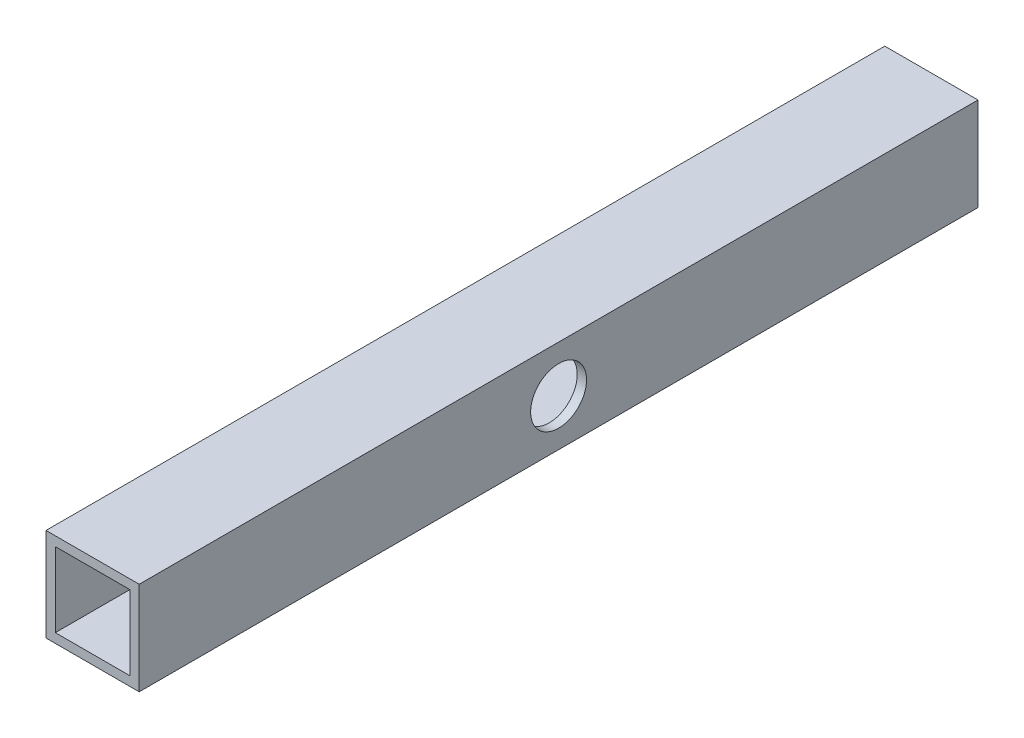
from build123d import *

# Parameters (mm, degrees)
ESQUISSE1_W             = 50
ESQUISSE1_H             = 50
ESQUISSE1_W_2           = 40
ESQUISSE1_H_2           = 40
BOSS_EXTRU_1_DEPTH      = 450
ESQUISSE2_R             = 15
ENL_V_MAT_EXTRU_1_DEPTH = 79


with BuildPart() as part:
    # Esquisse1 → Boss.-Extru.1 (new body)
    with BuildSketch(Plane.XY):
        with Locations((-25, 25)):
            Rectangle(ESQUISSE1_W, ESQUISSE1_H)
        with Locations((-25, 25)):
            Rectangle(ESQUISSE1_W_2, ESQUISSE1_H_2, mode=Mode.SUBTRACT)
    extrude(amount=BOSS_EXTRU_1_DEPTH)

    # Esquisse2 → Enl_v. mat.-Extru.1 (cut)
    with BuildSketch(Plane(origin=(0, 0, 0), x_dir=(0, 0, -1), z_dir=(1, 0, 0))):
        with Locations((-225, 25)):
            Circle(ESQUISSE2_R)
    extrude(amount=-ENL_V_MAT_EXTRU_1_DEPTH, mode=Mode.SUBTRACT)


solid = part.part
